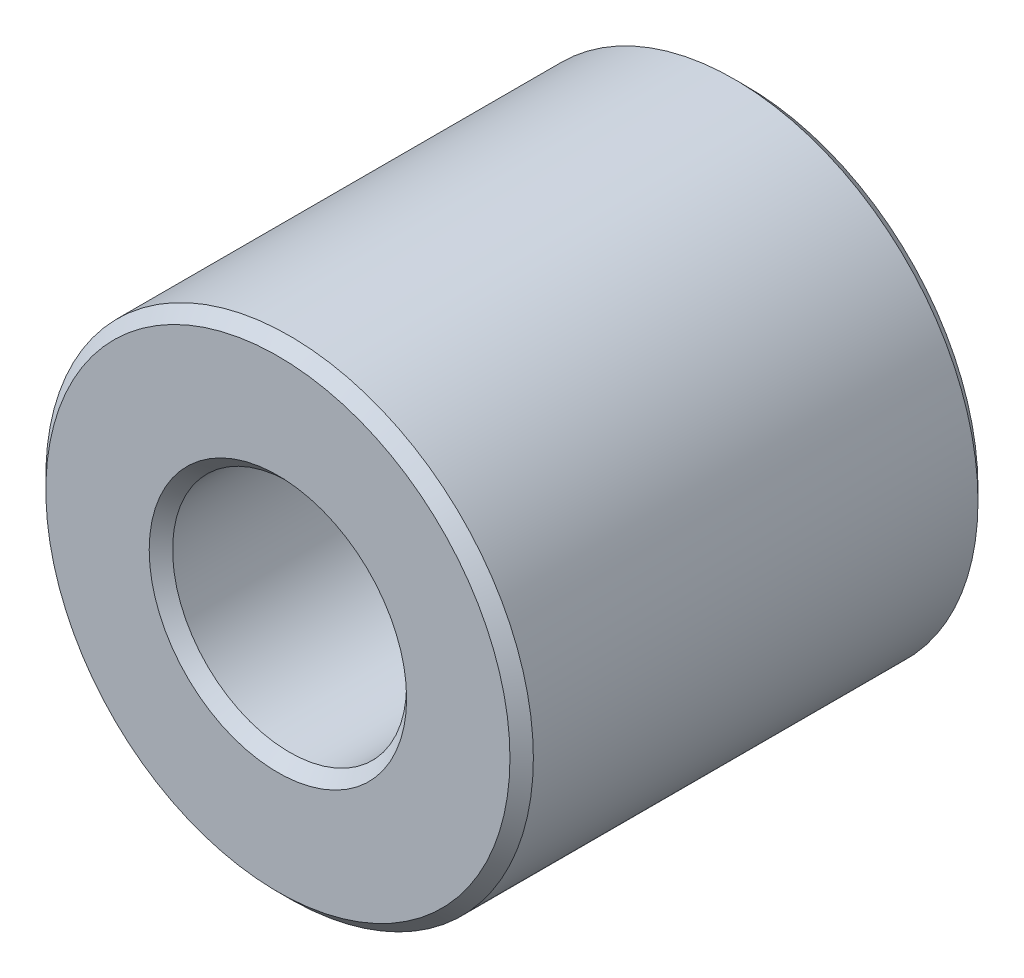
ISO-10303-21;
HEADER;
FILE_DESCRIPTION(('STEP AP214'),'2;1');
FILE_NAME('part.step','',(''),(''),'','','');
FILE_SCHEMA(('AUTOMOTIVE_DESIGN { 1 0 10303 214 1 1 1 1 }'));
ENDSEC;
DATA;
#1=APPLICATION_CONTEXT('core data for automotive mechanical design processes');
#2=APPLICATION_PROTOCOL_DEFINITION('international standard','automotive_design',2000,#1);
#3=PRODUCT_CONTEXT('',#1,'mechanical');
#4=PRODUCT('Part','Part','',(#3));
#5=PRODUCT_RELATED_PRODUCT_CATEGORY('part','',(#4));
#6=PRODUCT_DEFINITION_FORMATION('','',#4);
#7=PRODUCT_DEFINITION_CONTEXT('part definition',#1,'design');
#8=PRODUCT_DEFINITION('design','',#6,#7);
#9=PRODUCT_DEFINITION_SHAPE('','',#8);
#10=(LENGTH_UNIT() NAMED_UNIT(*) SI_UNIT(.MILLI.,.METRE.));
#11=(NAMED_UNIT(*) PLANE_ANGLE_UNIT() SI_UNIT($,.RADIAN.));
#12=(NAMED_UNIT(*) SI_UNIT($,.STERADIAN.) SOLID_ANGLE_UNIT());
#13=UNCERTAINTY_MEASURE_WITH_UNIT(LENGTH_MEASURE(1.E-05),#10,'distance_accuracy_value','');
#14=(GEOMETRIC_REPRESENTATION_CONTEXT(3) GLOBAL_UNCERTAINTY_ASSIGNED_CONTEXT((#13)) GLOBAL_UNIT_ASSIGNED_CONTEXT((#10,
#11,#12)) REPRESENTATION_CONTEXT('',''));
#15=CARTESIAN_POINT('',(0.,0.,0.));
#16=DIRECTION('',(0.,0.,1.));
#17=DIRECTION('',(1.,0.,0.));
#18=AXIS2_PLACEMENT_3D('',#15,#16,#17);
#19=CARTESIAN_POINT('',(0.,0.,36.));
#20=DIRECTION('',(0.,0.,1.));
#21=DIRECTION('',(1.,0.,0.));
#22=AXIS2_PLACEMENT_3D('',#19,#20,#21);
#23=PLANE('',#22);
#24=CARTESIAN_POINT('',(0.,0.,36.));
#25=DIRECTION('',(0.,0.,1.));
#26=DIRECTION('',(1.,0.,0.));
#27=AXIS2_PLACEMENT_3D('',#24,#25,#26);
#28=CIRCLE('',#27,19.8);
#29=CARTESIAN_POINT('',(19.8,0.,36.));
#30=VERTEX_POINT('',#29);
#31=EDGE_CURVE('E10',#30,#30,#28,.F.);
#32=ORIENTED_EDGE('',*,*,#31,.T.);
#33=EDGE_LOOP('',(#32));
#34=FACE_BOUND('',#33,.T.);
#35=CARTESIAN_POINT('',(0.,0.,36.));
#36=DIRECTION('',(0.,0.,1.));
#37=DIRECTION('',(1.,0.,0.));
#38=AXIS2_PLACEMENT_3D('',#35,#36,#37);
#39=CIRCLE('',#38,35.7);
#40=CARTESIAN_POINT('',(35.7,0.,36.));
#41=VERTEX_POINT('',#40);
#42=EDGE_CURVE('E40',#41,#41,#39,.T.);
#43=ORIENTED_EDGE('',*,*,#42,.T.);
#44=EDGE_LOOP('',(#43));
#45=FACE_BOUND('',#44,.T.);
#46=ADVANCED_FACE('F33',(#34,#45),#23,.T.);
#47=CARTESIAN_POINT('',(0.,0.,-36.));
#48=DIRECTION('',(0.,0.,1.));
#49=DIRECTION('',(1.,0.,0.));
#50=AXIS2_PLACEMENT_3D('',#47,#48,#49);
#51=PLANE('',#50);
#52=CARTESIAN_POINT('',(0.,0.,-36.));
#53=DIRECTION('',(0.,0.,1.));
#54=DIRECTION('',(1.,0.,0.));
#55=AXIS2_PLACEMENT_3D('',#52,#53,#54);
#56=CIRCLE('',#55,19.8);
#57=CARTESIAN_POINT('',(19.8,0.,-36.));
#58=VERTEX_POINT('',#57);
#59=EDGE_CURVE('E59',#58,#58,#56,.T.);
#60=ORIENTED_EDGE('',*,*,#59,.T.);
#61=EDGE_LOOP('',(#60));
#62=FACE_BOUND('',#61,.T.);
#63=CARTESIAN_POINT('',(0.,0.,-36.));
#64=DIRECTION('',(0.,0.,1.));
#65=DIRECTION('',(1.,0.,0.));
#66=AXIS2_PLACEMENT_3D('',#63,#64,#65);
#67=CIRCLE('',#66,35.7);
#68=CARTESIAN_POINT('',(35.7,0.,-36.));
#69=VERTEX_POINT('',#68);
#70=EDGE_CURVE('E62',#69,#69,#67,.F.);
#71=ORIENTED_EDGE('',*,*,#70,.T.);
#72=EDGE_LOOP('',(#71));
#73=FACE_BOUND('',#72,.T.);
#74=ADVANCED_FACE('F66',(#62,#73),#51,.F.);
#75=CARTESIAN_POINT('',(0.,0.,36.));
#76=DIRECTION('',(0.,0.,-1.));
#77=DIRECTION('',(-1.,0.,0.));
#78=AXIS2_PLACEMENT_3D('',#75,#76,#77);
#79=CYLINDRICAL_SURFACE('',#78,37.5);
#80=CARTESIAN_POINT('',(0.,0.,-34.2));
#81=DIRECTION('',(0.,0.,1.));
#82=DIRECTION('',(1.,0.,0.));
#83=AXIS2_PLACEMENT_3D('',#80,#81,#82);
#84=CIRCLE('',#83,37.5);
#85=CARTESIAN_POINT('',(37.5,0.,-34.2));
#86=VERTEX_POINT('',#85);
#87=EDGE_CURVE('E44',#86,#86,#84,.T.);
#88=ORIENTED_EDGE('',*,*,#87,.T.);
#89=EDGE_LOOP('',(#88));
#90=FACE_BOUND('',#89,.T.);
#91=CARTESIAN_POINT('',(0.,0.,34.2));
#92=DIRECTION('',(0.,0.,1.));
#93=DIRECTION('',(1.,0.,0.));
#94=AXIS2_PLACEMENT_3D('',#91,#92,#93);
#95=CIRCLE('',#94,37.5);
#96=CARTESIAN_POINT('',(37.5,0.,34.2));
#97=VERTEX_POINT('',#96);
#98=EDGE_CURVE('E48',#97,#97,#95,.F.);
#99=ORIENTED_EDGE('',*,*,#98,.T.);
#100=EDGE_LOOP('',(#99));
#101=FACE_BOUND('',#100,.T.);
#102=ADVANCED_FACE('F76',(#90,#101),#79,.T.);
#103=CARTESIAN_POINT('',(0.,0.,36.));
#104=DIRECTION('',(0.,0.,-1.));
#105=DIRECTION('',(-1.,0.,0.));
#106=AXIS2_PLACEMENT_3D('',#103,#104,#105);
#107=CYLINDRICAL_SURFACE('',#106,18.);
#108=CARTESIAN_POINT('',(0.,0.,-34.2));
#109=DIRECTION('',(0.,0.,1.));
#110=DIRECTION('',(1.,0.,0.));
#111=AXIS2_PLACEMENT_3D('',#108,#109,#110);
#112=CIRCLE('',#111,18.);
#113=CARTESIAN_POINT('',(18.,0.,-34.2));
#114=VERTEX_POINT('',#113);
#115=EDGE_CURVE('E53',#114,#114,#112,.F.);
#116=ORIENTED_EDGE('',*,*,#115,.T.);
#117=EDGE_LOOP('',(#116));
#118=FACE_BOUND('',#117,.T.);
#119=CARTESIAN_POINT('',(0.,0.,34.2));
#120=DIRECTION('',(0.,0.,1.));
#121=DIRECTION('',(1.,0.,0.));
#122=AXIS2_PLACEMENT_3D('',#119,#120,#121);
#123=CIRCLE('',#122,18.);
#124=CARTESIAN_POINT('',(18.,0.,34.2));
#125=VERTEX_POINT('',#124);
#126=EDGE_CURVE('E56',#125,#125,#123,.T.);
#127=ORIENTED_EDGE('',*,*,#126,.T.);
#128=EDGE_LOOP('',(#127));
#129=FACE_BOUND('',#128,.T.);
#130=ADVANCED_FACE('F79',(#118,#129),#107,.F.);
#131=CARTESIAN_POINT('',(0.,0.,-36.));
#132=DIRECTION('',(0.,0.,-1.));
#133=DIRECTION('',(-1.,0.,0.));
#134=AXIS2_PLACEMENT_3D('',#131,#132,#133);
#135=CONICAL_SURFACE('',#134,19.8,0.785398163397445);
#136=ORIENTED_EDGE('',*,*,#115,.F.);
#137=EDGE_LOOP('',(#136));
#138=FACE_BOUND('',#137,.T.);
#139=ORIENTED_EDGE('',*,*,#59,.F.);
#140=EDGE_LOOP('',(#139));
#141=FACE_BOUND('',#140,.T.);
#142=ADVANCED_FACE('F72',(#138,#141),#135,.F.);
#143=CARTESIAN_POINT('',(0.,0.,-34.2));
#144=DIRECTION('',(0.,0.,1.));
#145=DIRECTION('',(1.,0.,0.));
#146=AXIS2_PLACEMENT_3D('',#143,#144,#145);
#147=CONICAL_SURFACE('',#146,37.5,0.78539816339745);
#148=ORIENTED_EDGE('',*,*,#70,.F.);
#149=EDGE_LOOP('',(#148));
#150=FACE_BOUND('',#149,.T.);
#151=ORIENTED_EDGE('',*,*,#87,.F.);
#152=EDGE_LOOP('',(#151));
#153=FACE_BOUND('',#152,.T.);
#154=ADVANCED_FACE('F68',(#150,#153),#147,.T.);
#155=CARTESIAN_POINT('',(0.,0.,34.2));
#156=DIRECTION('',(0.,0.,1.));
#157=DIRECTION('',(1.,0.,0.));
#158=AXIS2_PLACEMENT_3D('',#155,#156,#157);
#159=CONICAL_SURFACE('',#158,18.,0.785398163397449);
#160=ORIENTED_EDGE('',*,*,#31,.F.);
#161=EDGE_LOOP('',(#160));
#162=FACE_BOUND('',#161,.T.);
#163=ORIENTED_EDGE('',*,*,#126,.F.);
#164=EDGE_LOOP('',(#163));
#165=FACE_BOUND('',#164,.T.);
#166=ADVANCED_FACE('F71',(#162,#165),#159,.F.);
#167=CARTESIAN_POINT('',(0.,0.,36.));
#168=DIRECTION('',(0.,0.,-1.));
#169=DIRECTION('',(-1.,0.,0.));
#170=AXIS2_PLACEMENT_3D('',#167,#168,#169);
#171=CONICAL_SURFACE('',#170,35.7,0.785398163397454);
#172=ORIENTED_EDGE('',*,*,#98,.F.);
#173=EDGE_LOOP('',(#172));
#174=FACE_BOUND('',#173,.T.);
#175=ORIENTED_EDGE('',*,*,#42,.F.);
#176=EDGE_LOOP('',(#175));
#177=FACE_BOUND('',#176,.T.);
#178=ADVANCED_FACE('F35',(#174,#177),#171,.T.);
#179=CLOSED_SHELL('',(#46,#74,#102,#130,#142,#154,#166,#178));
#180=MANIFOLD_SOLID_BREP('B2',#179);
#181=ADVANCED_BREP_SHAPE_REPRESENTATION('',(#18,#180),#14);
#182=SHAPE_DEFINITION_REPRESENTATION(#9,#181);
ENDSEC;
END-ISO-10303-21;
